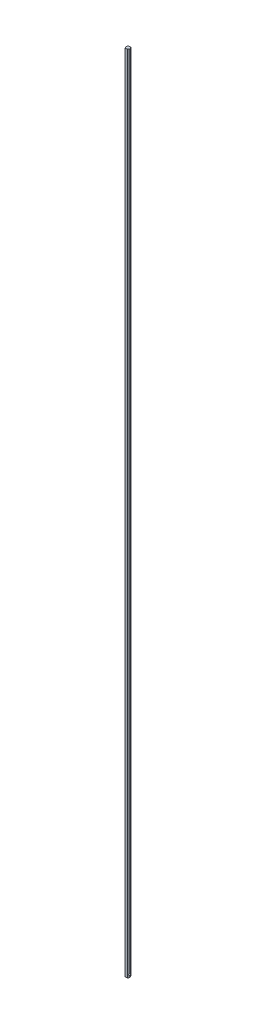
ISO-10303-21;
HEADER;
FILE_DESCRIPTION(('STEP AP214'),'2;1');
FILE_NAME('part.step','',(''),(''),'','','');
FILE_SCHEMA(('AUTOMOTIVE_DESIGN { 1 0 10303 214 1 1 1 1 }'));
ENDSEC;
DATA;
#1=APPLICATION_CONTEXT('core data for automotive mechanical design processes');
#2=APPLICATION_PROTOCOL_DEFINITION('international standard','automotive_design',2000,#1);
#3=PRODUCT_CONTEXT('',#1,'mechanical');
#4=PRODUCT('Part','Part','',(#3));
#5=PRODUCT_RELATED_PRODUCT_CATEGORY('part','',(#4));
#6=PRODUCT_DEFINITION_FORMATION('','',#4);
#7=PRODUCT_DEFINITION_CONTEXT('part definition',#1,'design');
#8=PRODUCT_DEFINITION('design','',#6,#7);
#9=PRODUCT_DEFINITION_SHAPE('','',#8);
#10=(LENGTH_UNIT() NAMED_UNIT(*) SI_UNIT(.MILLI.,.METRE.));
#11=(NAMED_UNIT(*) PLANE_ANGLE_UNIT() SI_UNIT($,.RADIAN.));
#12=(NAMED_UNIT(*) SI_UNIT($,.STERADIAN.) SOLID_ANGLE_UNIT());
#13=UNCERTAINTY_MEASURE_WITH_UNIT(LENGTH_MEASURE(1.E-05),#10,'distance_accuracy_value','');
#14=(GEOMETRIC_REPRESENTATION_CONTEXT(3) GLOBAL_UNCERTAINTY_ASSIGNED_CONTEXT((#13)) GLOBAL_UNIT_ASSIGNED_CONTEXT((#10,
#11,#12)) REPRESENTATION_CONTEXT('',''));
#15=CARTESIAN_POINT('',(0.,0.,0.));
#16=DIRECTION('',(0.,0.,1.));
#17=DIRECTION('',(1.,0.,0.));
#18=AXIS2_PLACEMENT_3D('',#15,#16,#17);
#19=CARTESIAN_POINT('',(5.77350269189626,4550.,10.));
#20=DIRECTION('',(-0.866025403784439,0.,-0.5));
#21=DIRECTION('',(-0.5,0.,0.866025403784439));
#22=AXIS2_PLACEMENT_3D('',#19,#20,#21);
#23=PLANE('',#22);
#24=DIRECTION('',(0.,-1.,0.));
#25=VECTOR('',#24,1.);
#26=CARTESIAN_POINT('',(11.5470053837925,4550.,0.));
#27=LINE('',#26,#25);
#28=CARTESIAN_POINT('',(11.5470053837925,10.0000000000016,0.));
#29=VERTEX_POINT('',#28);
#30=CARTESIAN_POINT('',(11.5470053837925,0.,0.));
#31=VERTEX_POINT('',#30);
#32=EDGE_CURVE('E126',#29,#31,#27,.T.);
#33=ORIENTED_EDGE('',*,*,#32,.F.);
#34=CARTESIAN_POINT('',(11.5470053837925,15.,0.));
#35=DIRECTION('',(-0.866025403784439,0.,-0.5));
#36=DIRECTION('',(-0.5,0.,0.866025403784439));
#37=AXIS2_PLACEMENT_3D('',#34,#35,#36);
#38=ELLIPSE('',#37,5.77350269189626,5.);
#39=CARTESIAN_POINT('',(11.5470053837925,20.,0.));
#40=VERTEX_POINT('',#39);
#41=EDGE_CURVE('E52',#29,#40,#38,.T.);
#42=ORIENTED_EDGE('',*,*,#41,.T.);
#43=CARTESIAN_POINT('',(11.5470053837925,4550.,0.));
#44=VERTEX_POINT('',#43);
#45=EDGE_CURVE('E46',#44,#40,#27,.T.);
#46=ORIENTED_EDGE('',*,*,#45,.F.);
#47=DIRECTION('',(0.5,0.,-0.866025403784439));
#48=VECTOR('',#47,1.);
#49=CARTESIAN_POINT('',(5.77350269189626,4550.,10.));
#50=LINE('',#49,#48);
#51=CARTESIAN_POINT('',(5.77350269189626,4550.,10.));
#52=VERTEX_POINT('',#51);
#53=EDGE_CURVE('E162',#52,#44,#50,.T.);
#54=ORIENTED_EDGE('',*,*,#53,.F.);
#55=DIRECTION('',(0.,-1.,0.));
#56=VECTOR('',#55,1.);
#57=CARTESIAN_POINT('',(5.77350269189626,4550.,10.));
#58=LINE('',#57,#56);
#59=CARTESIAN_POINT('',(5.77350269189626,0.,10.));
#60=VERTEX_POINT('',#59);
#61=EDGE_CURVE('E149',#52,#60,#58,.T.);
#62=ORIENTED_EDGE('',*,*,#61,.T.);
#63=DIRECTION('',(0.5,0.,-0.866025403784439));
#64=VECTOR('',#63,1.);
#65=CARTESIAN_POINT('',(5.77350269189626,0.,10.));
#66=LINE('',#65,#64);
#67=EDGE_CURVE('E142',#60,#31,#66,.T.);
#68=ORIENTED_EDGE('',*,*,#67,.T.);
#69=EDGE_LOOP('',(#33,#42,#46,#54,#62,#68));
#70=FACE_BOUND('',#69,.T.);
#71=ADVANCED_FACE('F39',(#70),#23,.F.);
#72=CARTESIAN_POINT('',(11.5470053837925,4550.,0.));
#73=DIRECTION('',(-0.866025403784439,0.,0.5));
#74=DIRECTION('',(0.5,0.,0.866025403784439));
#75=AXIS2_PLACEMENT_3D('',#72,#73,#74);
#76=PLANE('',#75);
#77=ORIENTED_EDGE('',*,*,#45,.T.);
#78=CARTESIAN_POINT('',(11.5470053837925,15.,0.));
#79=DIRECTION('',(-0.866025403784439,0.,0.5));
#80=DIRECTION('',(-0.5,0.,-0.866025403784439));
#81=AXIS2_PLACEMENT_3D('',#78,#79,#80);
#82=ELLIPSE('',#81,5.77350269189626,5.);
#83=EDGE_CURVE('E111',#40,#29,#82,.T.);
#84=ORIENTED_EDGE('',*,*,#83,.T.);
#85=ORIENTED_EDGE('',*,*,#32,.T.);
#86=DIRECTION('',(-0.5,0.,-0.866025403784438));
#87=VECTOR('',#86,1.);
#88=CARTESIAN_POINT('',(11.5470053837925,0.,0.));
#89=LINE('',#88,#87);
#90=CARTESIAN_POINT('',(5.77350269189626,0.,-10.));
#91=VERTEX_POINT('',#90);
#92=EDGE_CURVE('E134',#31,#91,#89,.T.);
#93=ORIENTED_EDGE('',*,*,#92,.T.);
#94=DIRECTION('',(0.,-1.,0.));
#95=VECTOR('',#94,1.);
#96=CARTESIAN_POINT('',(5.77350269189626,4550.,-10.));
#97=LINE('',#96,#95);
#98=CARTESIAN_POINT('',(5.77350269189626,4550.,-10.));
#99=VERTEX_POINT('',#98);
#100=EDGE_CURVE('E119',#99,#91,#97,.T.);
#101=ORIENTED_EDGE('',*,*,#100,.F.);
#102=DIRECTION('',(-0.5,0.,-0.866025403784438));
#103=VECTOR('',#102,1.);
#104=CARTESIAN_POINT('',(11.5470053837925,4550.,0.));
#105=LINE('',#104,#103);
#106=EDGE_CURVE('E173',#44,#99,#105,.T.);
#107=ORIENTED_EDGE('',*,*,#106,.F.);
#108=EDGE_LOOP('',(#77,#84,#85,#93,#101,#107));
#109=FACE_BOUND('',#108,.T.);
#110=ADVANCED_FACE('F132',(#109),#76,.F.);
#111=CARTESIAN_POINT('',(5.77350269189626,4550.,-10.));
#112=DIRECTION('',(0.,0.,1.));
#113=DIRECTION('',(1.,0.,0.));
#114=AXIS2_PLACEMENT_3D('',#111,#112,#113);
#115=PLANE('',#114);
#116=DIRECTION('',(-1.,0.,0.));
#117=VECTOR('',#116,1.);
#118=CARTESIAN_POINT('',(5.77350269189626,0.,-10.));
#119=LINE('',#118,#117);
#120=CARTESIAN_POINT('',(-5.77350269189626,0.,-10.));
#121=VERTEX_POINT('',#120);
#122=EDGE_CURVE('E144',#91,#121,#119,.T.);
#123=ORIENTED_EDGE('',*,*,#122,.T.);
#124=DIRECTION('',(0.,-1.,0.));
#125=VECTOR('',#124,1.);
#126=CARTESIAN_POINT('',(-5.77350269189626,4550.,-10.));
#127=LINE('',#126,#125);
#128=CARTESIAN_POINT('',(-5.77350269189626,4550.,-10.));
#129=VERTEX_POINT('',#128);
#130=EDGE_CURVE('E116',#129,#121,#127,.T.);
#131=ORIENTED_EDGE('',*,*,#130,.F.);
#132=DIRECTION('',(-1.,0.,0.));
#133=VECTOR('',#132,1.);
#134=CARTESIAN_POINT('',(5.77350269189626,4550.,-10.));
#135=LINE('',#134,#133);
#136=EDGE_CURVE('E169',#99,#129,#135,.T.);
#137=ORIENTED_EDGE('',*,*,#136,.F.);
#138=ORIENTED_EDGE('',*,*,#100,.T.);
#139=EDGE_LOOP('',(#123,#131,#137,#138));
#140=FACE_BOUND('',#139,.T.);
#141=ADVANCED_FACE('F180',(#140),#115,.F.);
#142=CARTESIAN_POINT('',(-5.77350269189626,4550.,-10.));
#143=DIRECTION('',(0.866025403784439,0.,0.5));
#144=DIRECTION('',(0.5,0.,-0.866025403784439));
#145=AXIS2_PLACEMENT_3D('',#142,#143,#144);
#146=PLANE('',#145);
#147=DIRECTION('',(0.,-1.,0.));
#148=VECTOR('',#147,1.);
#149=CARTESIAN_POINT('',(-11.5470053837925,4550.,0.));
#150=LINE('',#149,#148);
#151=CARTESIAN_POINT('',(-11.5470053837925,10.0000000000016,0.));
#152=VERTEX_POINT('',#151);
#153=CARTESIAN_POINT('',(-11.5470053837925,0.,0.));
#154=VERTEX_POINT('',#153);
#155=EDGE_CURVE('E110',#152,#154,#150,.T.);
#156=ORIENTED_EDGE('',*,*,#155,.F.);
#157=CARTESIAN_POINT('',(-11.5470053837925,15.,0.));
#158=DIRECTION('',(0.866025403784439,0.,0.5));
#159=DIRECTION('',(-0.5,0.,0.866025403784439));
#160=AXIS2_PLACEMENT_3D('',#157,#158,#159);
#161=ELLIPSE('',#160,5.77350269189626,5.);
#162=CARTESIAN_POINT('',(-11.5470053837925,20.,0.));
#163=VERTEX_POINT('',#162);
#164=EDGE_CURVE('E59',#152,#163,#161,.T.);
#165=ORIENTED_EDGE('',*,*,#164,.T.);
#166=CARTESIAN_POINT('',(-11.5470053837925,4550.,0.));
#167=VERTEX_POINT('',#166);
#168=EDGE_CURVE('E107',#167,#163,#150,.T.);
#169=ORIENTED_EDGE('',*,*,#168,.F.);
#170=DIRECTION('',(-0.5,0.,0.866025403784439));
#171=VECTOR('',#170,1.);
#172=CARTESIAN_POINT('',(-5.77350269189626,4550.,-10.));
#173=LINE('',#172,#171);
#174=EDGE_CURVE('E168',#129,#167,#173,.T.);
#175=ORIENTED_EDGE('',*,*,#174,.F.);
#176=ORIENTED_EDGE('',*,*,#130,.T.);
#177=DIRECTION('',(-0.5,0.,0.866025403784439));
#178=VECTOR('',#177,1.);
#179=CARTESIAN_POINT('',(-5.77350269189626,0.,-10.));
#180=LINE('',#179,#178);
#181=EDGE_CURVE('E157',#121,#154,#180,.T.);
#182=ORIENTED_EDGE('',*,*,#181,.T.);
#183=EDGE_LOOP('',(#156,#165,#169,#175,#176,#182));
#184=FACE_BOUND('',#183,.T.);
#185=ADVANCED_FACE('F105',(#184),#146,.F.);
#186=CARTESIAN_POINT('',(-11.5470053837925,4550.,0.));
#187=DIRECTION('',(0.866025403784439,0.,-0.5));
#188=DIRECTION('',(-0.5,0.,-0.866025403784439));
#189=AXIS2_PLACEMENT_3D('',#186,#187,#188);
#190=PLANE('',#189);
#191=ORIENTED_EDGE('',*,*,#168,.T.);
#192=CARTESIAN_POINT('',(-11.5470053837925,15.,0.));
#193=DIRECTION('',(0.866025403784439,0.,-0.5));
#194=DIRECTION('',(-0.5,0.,-0.866025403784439));
#195=AXIS2_PLACEMENT_3D('',#192,#193,#194);
#196=ELLIPSE('',#195,5.77350269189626,5.);
#197=EDGE_CURVE('E12',#163,#152,#196,.T.);
#198=ORIENTED_EDGE('',*,*,#197,.T.);
#199=ORIENTED_EDGE('',*,*,#155,.T.);
#200=DIRECTION('',(0.5,0.,0.866025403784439));
#201=VECTOR('',#200,1.);
#202=CARTESIAN_POINT('',(-11.5470053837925,0.,0.));
#203=LINE('',#202,#201);
#204=CARTESIAN_POINT('',(-5.77350269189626,0.,10.));
#205=VERTEX_POINT('',#204);
#206=EDGE_CURVE('E159',#154,#205,#203,.T.);
#207=ORIENTED_EDGE('',*,*,#206,.T.);
#208=DIRECTION('',(0.,-1.,0.));
#209=VECTOR('',#208,1.);
#210=CARTESIAN_POINT('',(-5.77350269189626,4550.,10.));
#211=LINE('',#210,#209);
#212=CARTESIAN_POINT('',(-5.77350269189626,4550.,10.));
#213=VERTEX_POINT('',#212);
#214=EDGE_CURVE('E121',#213,#205,#211,.T.);
#215=ORIENTED_EDGE('',*,*,#214,.F.);
#216=DIRECTION('',(0.5,0.,0.866025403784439));
#217=VECTOR('',#216,1.);
#218=CARTESIAN_POINT('',(-11.5470053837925,4550.,0.));
#219=LINE('',#218,#217);
#220=EDGE_CURVE('E115',#167,#213,#219,.T.);
#221=ORIENTED_EDGE('',*,*,#220,.F.);
#222=EDGE_LOOP('',(#191,#198,#199,#207,#215,#221));
#223=FACE_BOUND('',#222,.T.);
#224=ADVANCED_FACE('F113',(#223),#190,.F.);
#225=CARTESIAN_POINT('',(-5.77350269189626,4550.,10.));
#226=DIRECTION('',(0.,0.,-1.));
#227=DIRECTION('',(-1.,0.,0.));
#228=AXIS2_PLACEMENT_3D('',#225,#226,#227);
#229=PLANE('',#228);
#230=DIRECTION('',(1.,0.,0.));
#231=VECTOR('',#230,1.);
#232=CARTESIAN_POINT('',(-5.77350269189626,0.,10.));
#233=LINE('',#232,#231);
#234=EDGE_CURVE('E161',#205,#60,#233,.T.);
#235=ORIENTED_EDGE('',*,*,#234,.T.);
#236=ORIENTED_EDGE('',*,*,#61,.F.);
#237=DIRECTION('',(1.,0.,0.));
#238=VECTOR('',#237,1.);
#239=CARTESIAN_POINT('',(-5.77350269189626,4550.,10.));
#240=LINE('',#239,#238);
#241=EDGE_CURVE('E153',#213,#52,#240,.T.);
#242=ORIENTED_EDGE('',*,*,#241,.F.);
#243=ORIENTED_EDGE('',*,*,#214,.T.);
#244=EDGE_LOOP('',(#235,#236,#242,#243));
#245=FACE_BOUND('',#244,.T.);
#246=ADVANCED_FACE('F183',(#245),#229,.F.);
#247=CARTESIAN_POINT('',(0.,4550.,0.));
#248=DIRECTION('',(0.,1.,0.));
#249=DIRECTION('',(0.,0.,1.));
#250=AXIS2_PLACEMENT_3D('',#247,#248,#249);
#251=PLANE('',#250);
#252=ORIENTED_EDGE('',*,*,#53,.T.);
#253=ORIENTED_EDGE('',*,*,#106,.T.);
#254=ORIENTED_EDGE('',*,*,#136,.T.);
#255=ORIENTED_EDGE('',*,*,#174,.T.);
#256=ORIENTED_EDGE('',*,*,#220,.T.);
#257=ORIENTED_EDGE('',*,*,#241,.T.);
#258=EDGE_LOOP('',(#252,#253,#254,#255,#256,#257));
#259=FACE_BOUND('',#258,.T.);
#260=ADVANCED_FACE('F176',(#259),#251,.T.);
#261=CARTESIAN_POINT('',(0.,0.,0.));
#262=DIRECTION('',(0.,1.,0.));
#263=DIRECTION('',(0.,0.,1.));
#264=AXIS2_PLACEMENT_3D('',#261,#262,#263);
#265=PLANE('',#264);
#266=ORIENTED_EDGE('',*,*,#67,.F.);
#267=ORIENTED_EDGE('',*,*,#234,.F.);
#268=ORIENTED_EDGE('',*,*,#206,.F.);
#269=ORIENTED_EDGE('',*,*,#181,.F.);
#270=ORIENTED_EDGE('',*,*,#122,.F.);
#271=ORIENTED_EDGE('',*,*,#92,.F.);
#272=EDGE_LOOP('',(#266,#267,#268,#269,#270,#271));
#273=FACE_BOUND('',#272,.T.);
#274=ADVANCED_FACE('F140',(#273),#265,.F.);
#275=CARTESIAN_POINT('',(11.5470053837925,15.,0.));
#276=DIRECTION('',(-1.,0.,0.));
#277=DIRECTION('',(0.,0.,1.));
#278=AXIS2_PLACEMENT_3D('',#275,#276,#277);
#279=CYLINDRICAL_SURFACE('',#278,5.);
#280=ORIENTED_EDGE('',*,*,#197,.F.);
#281=ORIENTED_EDGE('',*,*,#164,.F.);
#282=EDGE_LOOP('',(#280,#281));
#283=FACE_BOUND('',#282,.T.);
#284=ORIENTED_EDGE('',*,*,#83,.F.);
#285=ORIENTED_EDGE('',*,*,#41,.F.);
#286=EDGE_LOOP('',(#284,#285));
#287=FACE_BOUND('',#286,.T.);
#288=ADVANCED_FACE('F99',(#283,#287),#279,.F.);
#289=CLOSED_SHELL('',(#71,#110,#141,#185,#224,#246,#260,#274,#288));
#290=MANIFOLD_SOLID_BREP('B2',#289);
#291=ADVANCED_BREP_SHAPE_REPRESENTATION('',(#18,#290),#14);
#292=SHAPE_DEFINITION_REPRESENTATION(#9,#291);
ENDSEC;
END-ISO-10303-21;
